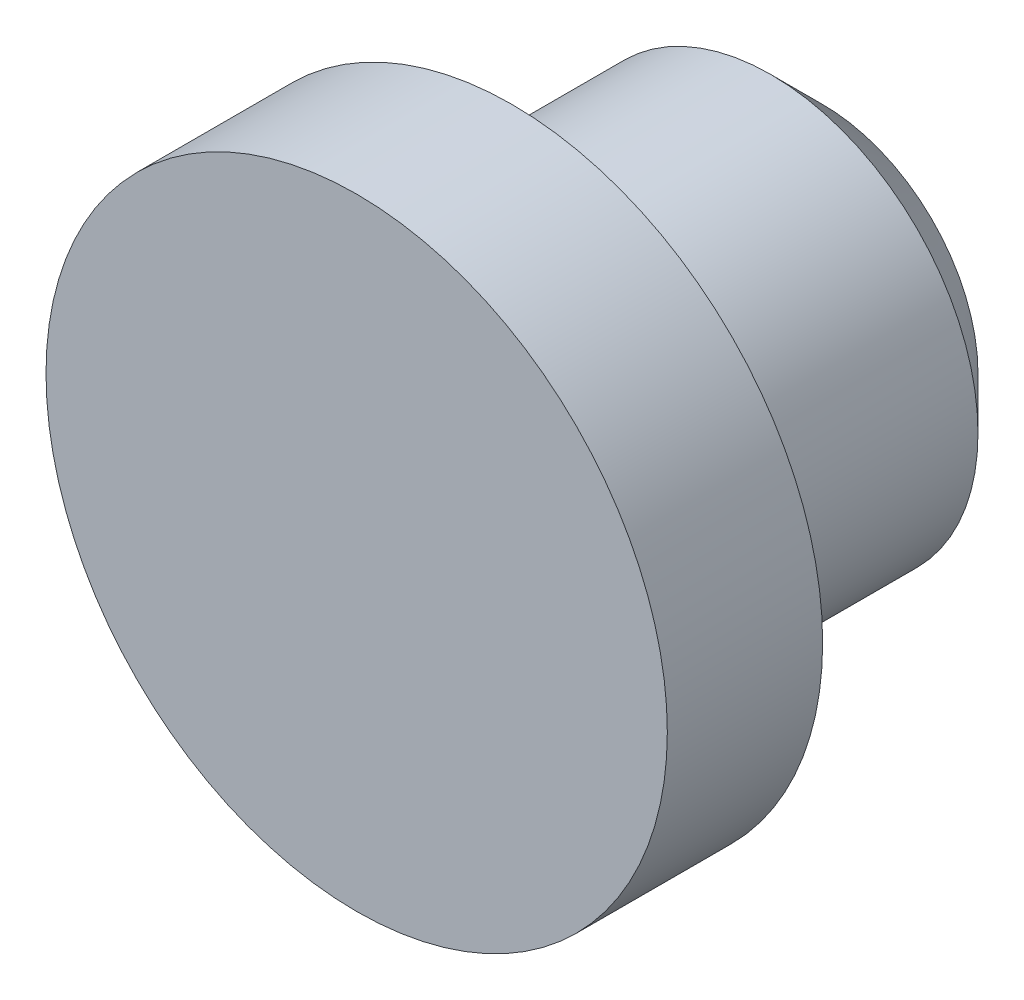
ISO-10303-21;
HEADER;
FILE_DESCRIPTION(('STEP AP214'),'2;1');
FILE_NAME('part.step','',(''),(''),'','','');
FILE_SCHEMA(('AUTOMOTIVE_DESIGN { 1 0 10303 214 1 1 1 1 }'));
ENDSEC;
DATA;
#1=APPLICATION_CONTEXT('core data for automotive mechanical design processes');
#2=APPLICATION_PROTOCOL_DEFINITION('international standard','automotive_design',2000,#1);
#3=PRODUCT_CONTEXT('',#1,'mechanical');
#4=PRODUCT('Part','Part','',(#3));
#5=PRODUCT_RELATED_PRODUCT_CATEGORY('part','',(#4));
#6=PRODUCT_DEFINITION_FORMATION('','',#4);
#7=PRODUCT_DEFINITION_CONTEXT('part definition',#1,'design');
#8=PRODUCT_DEFINITION('design','',#6,#7);
#9=PRODUCT_DEFINITION_SHAPE('','',#8);
#10=(LENGTH_UNIT() NAMED_UNIT(*) SI_UNIT(.MILLI.,.METRE.));
#11=(NAMED_UNIT(*) PLANE_ANGLE_UNIT() SI_UNIT($,.RADIAN.));
#12=(NAMED_UNIT(*) SI_UNIT($,.STERADIAN.) SOLID_ANGLE_UNIT());
#13=UNCERTAINTY_MEASURE_WITH_UNIT(LENGTH_MEASURE(1.E-05),#10,'distance_accuracy_value','');
#14=(GEOMETRIC_REPRESENTATION_CONTEXT(3) GLOBAL_UNCERTAINTY_ASSIGNED_CONTEXT((#13)) GLOBAL_UNIT_ASSIGNED_CONTEXT((#10,
#11,#12)) REPRESENTATION_CONTEXT('',''));
#15=CARTESIAN_POINT('',(0.,0.,0.));
#16=DIRECTION('',(0.,0.,1.));
#17=DIRECTION('',(1.,0.,0.));
#18=AXIS2_PLACEMENT_3D('',#15,#16,#17);
#19=CARTESIAN_POINT('',(0.,0.,6.));
#20=DIRECTION('',(0.,0.,-1.));
#21=DIRECTION('',(-1.,0.,0.));
#22=AXIS2_PLACEMENT_3D('',#19,#20,#21);
#23=CYLINDRICAL_SURFACE('',#22,4.);
#24=CARTESIAN_POINT('',(0.,0.,1.));
#25=DIRECTION('',(0.,0.,1.));
#26=DIRECTION('',(1.,0.,0.));
#27=AXIS2_PLACEMENT_3D('',#24,#25,#26);
#28=CIRCLE('',#27,4.);
#29=CARTESIAN_POINT('',(4.,0.,1.));
#30=VERTEX_POINT('',#29);
#31=EDGE_CURVE('E44',#30,#30,#28,.T.);
#32=ORIENTED_EDGE('',*,*,#31,.T.);
#33=EDGE_LOOP('',(#32));
#34=FACE_BOUND('',#33,.T.);
#35=CARTESIAN_POINT('',(0.,0.,6.));
#36=DIRECTION('',(0.,0.,1.));
#37=DIRECTION('',(1.,0.,0.));
#38=AXIS2_PLACEMENT_3D('',#35,#36,#37);
#39=CIRCLE('',#38,4.);
#40=CARTESIAN_POINT('',(4.,0.,6.));
#41=VERTEX_POINT('',#40);
#42=EDGE_CURVE('E48',#41,#41,#39,.T.);
#43=ORIENTED_EDGE('',*,*,#42,.F.);
#44=EDGE_LOOP('',(#43));
#45=FACE_BOUND('',#44,.T.);
#46=ADVANCED_FACE('F36',(#34,#45),#23,.T.);
#47=CARTESIAN_POINT('',(0.,0.,0.));
#48=DIRECTION('',(0.,0.,1.));
#49=DIRECTION('',(1.,0.,0.));
#50=AXIS2_PLACEMENT_3D('',#47,#48,#49);
#51=PLANE('',#50);
#52=CARTESIAN_POINT('',(0.,0.,0.));
#53=DIRECTION('',(0.,0.,1.));
#54=DIRECTION('',(1.,0.,0.));
#55=AXIS2_PLACEMENT_3D('',#52,#53,#54);
#56=CIRCLE('',#55,3.);
#57=CARTESIAN_POINT('',(3.,0.,0.));
#58=VERTEX_POINT('',#57);
#59=EDGE_CURVE('E10',#58,#58,#56,.F.);
#60=ORIENTED_EDGE('',*,*,#59,.T.);
#61=EDGE_LOOP('',(#60));
#62=FACE_BOUND('',#61,.T.);
#63=ADVANCED_FACE('F66',(#62),#51,.F.);
#64=CARTESIAN_POINT('',(0.,0.,9.));
#65=DIRECTION('',(0.,0.,-1.));
#66=DIRECTION('',(-1.,0.,0.));
#67=AXIS2_PLACEMENT_3D('',#64,#65,#66);
#68=CYLINDRICAL_SURFACE('',#67,6.);
#69=CARTESIAN_POINT('',(0.,0.,9.));
#70=DIRECTION('',(0.,0.,1.));
#71=DIRECTION('',(1.,0.,0.));
#72=AXIS2_PLACEMENT_3D('',#69,#70,#71);
#73=CIRCLE('',#72,6.);
#74=CARTESIAN_POINT('',(6.,0.,9.));
#75=VERTEX_POINT('',#74);
#76=EDGE_CURVE('E52',#75,#75,#73,.T.);
#77=ORIENTED_EDGE('',*,*,#76,.F.);
#78=EDGE_LOOP('',(#77));
#79=FACE_BOUND('',#78,.T.);
#80=CARTESIAN_POINT('',(0.,0.,6.));
#81=DIRECTION('',(0.,0.,1.));
#82=DIRECTION('',(1.,0.,0.));
#83=AXIS2_PLACEMENT_3D('',#80,#81,#82);
#84=CIRCLE('',#83,6.);
#85=CARTESIAN_POINT('',(6.,0.,6.));
#86=VERTEX_POINT('',#85);
#87=EDGE_CURVE('E55',#86,#86,#84,.T.);
#88=ORIENTED_EDGE('',*,*,#87,.T.);
#89=EDGE_LOOP('',(#88));
#90=FACE_BOUND('',#89,.T.);
#91=ADVANCED_FACE('F63',(#79,#90),#68,.T.);
#92=CARTESIAN_POINT('',(0.,0.,9.));
#93=DIRECTION('',(0.,0.,1.));
#94=DIRECTION('',(1.,0.,0.));
#95=AXIS2_PLACEMENT_3D('',#92,#93,#94);
#96=PLANE('',#95);
#97=ORIENTED_EDGE('',*,*,#76,.T.);
#98=EDGE_LOOP('',(#97));
#99=FACE_BOUND('',#98,.T.);
#100=ADVANCED_FACE('F61',(#99),#96,.T.);
#101=CARTESIAN_POINT('',(0.,0.,6.));
#102=DIRECTION('',(0.,0.,1.));
#103=DIRECTION('',(1.,0.,0.));
#104=AXIS2_PLACEMENT_3D('',#101,#102,#103);
#105=PLANE('',#104);
#106=ORIENTED_EDGE('',*,*,#42,.T.);
#107=EDGE_LOOP('',(#106));
#108=FACE_BOUND('',#107,.T.);
#109=ORIENTED_EDGE('',*,*,#87,.F.);
#110=EDGE_LOOP('',(#109));
#111=FACE_BOUND('',#110,.T.);
#112=ADVANCED_FACE('F70',(#108,#111),#105,.F.);
#113=CARTESIAN_POINT('',(0.,0.,1.));
#114=DIRECTION('',(0.,0.,1.));
#115=DIRECTION('',(1.,0.,0.));
#116=AXIS2_PLACEMENT_3D('',#113,#114,#115);
#117=CONICAL_SURFACE('',#116,4.,0.78539816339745);
#118=ORIENTED_EDGE('',*,*,#59,.F.);
#119=EDGE_LOOP('',(#118));
#120=FACE_BOUND('',#119,.T.);
#121=ORIENTED_EDGE('',*,*,#31,.F.);
#122=EDGE_LOOP('',(#121));
#123=FACE_BOUND('',#122,.T.);
#124=ADVANCED_FACE('F39',(#120,#123),#117,.T.);
#125=CLOSED_SHELL('',(#46,#63,#91,#100,#112,#124));
#126=MANIFOLD_SOLID_BREP('B2',#125);
#127=ADVANCED_BREP_SHAPE_REPRESENTATION('',(#18,#126),#14);
#128=SHAPE_DEFINITION_REPRESENTATION(#9,#127);
ENDSEC;
END-ISO-10303-21;
